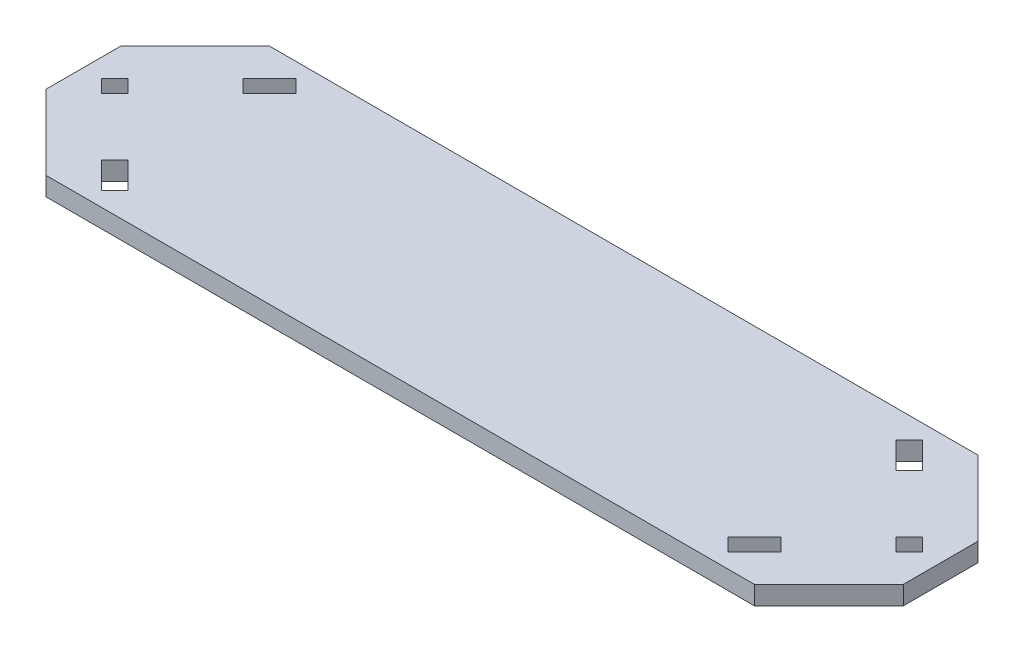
ISO-10303-21;
HEADER;
FILE_DESCRIPTION(('STEP AP214'),'2;1');
FILE_NAME('part.step','',(''),(''),'','','');
FILE_SCHEMA(('AUTOMOTIVE_DESIGN { 1 0 10303 214 1 1 1 1 }'));
ENDSEC;
DATA;
#1=APPLICATION_CONTEXT('core data for automotive mechanical design processes');
#2=APPLICATION_PROTOCOL_DEFINITION('international standard','automotive_design',2000,#1);
#3=PRODUCT_CONTEXT('',#1,'mechanical');
#4=PRODUCT('Part','Part','',(#3));
#5=PRODUCT_RELATED_PRODUCT_CATEGORY('part','',(#4));
#6=PRODUCT_DEFINITION_FORMATION('','',#4);
#7=PRODUCT_DEFINITION_CONTEXT('part definition',#1,'design');
#8=PRODUCT_DEFINITION('design','',#6,#7);
#9=PRODUCT_DEFINITION_SHAPE('','',#8);
#10=(LENGTH_UNIT() NAMED_UNIT(*) SI_UNIT(.MILLI.,.METRE.));
#11=(NAMED_UNIT(*) PLANE_ANGLE_UNIT() SI_UNIT($,.RADIAN.));
#12=(NAMED_UNIT(*) SI_UNIT($,.STERADIAN.) SOLID_ANGLE_UNIT());
#13=UNCERTAINTY_MEASURE_WITH_UNIT(LENGTH_MEASURE(1.E-05),#10,'distance_accuracy_value','');
#14=(GEOMETRIC_REPRESENTATION_CONTEXT(3) GLOBAL_UNCERTAINTY_ASSIGNED_CONTEXT((#13)) GLOBAL_UNIT_ASSIGNED_CONTEXT((#10,
#11,#12)) REPRESENTATION_CONTEXT('',''));
#15=CARTESIAN_POINT('',(0.,0.,0.));
#16=DIRECTION('',(0.,0.,1.));
#17=DIRECTION('',(1.,0.,0.));
#18=AXIS2_PLACEMENT_3D('',#15,#16,#17);
#19=CARTESIAN_POINT('',(0.,6.35,0.));
#20=DIRECTION('',(0.,1.,0.));
#21=DIRECTION('',(0.,0.,1.));
#22=AXIS2_PLACEMENT_3D('',#19,#20,#21);
#23=PLANE('',#22);
#24=DIRECTION('',(-0.707106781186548,0.,0.707106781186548));
#25=VECTOR('',#24,1.);
#26=CARTESIAN_POINT('',(115.705384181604,6.35,-24.0848719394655));
#27=LINE('',#26,#25);
#28=CARTESIAN_POINT('',(115.705384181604,6.35,-24.0848719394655));
#29=VERTEX_POINT('',#28);
#30=CARTESIAN_POINT('',(111.215256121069,6.35,-19.5947438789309));
#31=VERTEX_POINT('',#30);
#32=EDGE_CURVE('E289',#29,#31,#27,.T.);
#33=ORIENTED_EDGE('',*,*,#32,.T.);
#34=DIRECTION('',(-0.707106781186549,0.,-0.707106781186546));
#35=VECTOR('',#34,1.);
#36=CARTESIAN_POINT('',(111.215256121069,6.35,-19.5947438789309));
#37=LINE('',#36,#35);
#38=CARTESIAN_POINT('',(102.235,6.35,-28.575));
#39=VERTEX_POINT('',#38);
#40=EDGE_CURVE('E272',#31,#39,#37,.T.);
#41=ORIENTED_EDGE('',*,*,#40,.T.);
#42=DIRECTION('',(0.707106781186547,0.,-0.707106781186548));
#43=VECTOR('',#42,1.);
#44=CARTESIAN_POINT('',(102.235,6.35,-28.575));
#45=LINE('',#44,#43);
#46=CARTESIAN_POINT('',(106.725128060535,6.35,-33.0651280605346));
#47=VERTEX_POINT('',#46);
#48=EDGE_CURVE('E279',#39,#47,#45,.T.);
#49=ORIENTED_EDGE('',*,*,#48,.T.);
#50=DIRECTION('',(0.707106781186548,0.,0.707106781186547));
#51=VECTOR('',#50,1.);
#52=CARTESIAN_POINT('',(106.725128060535,6.35,-33.0651280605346));
#53=LINE('',#52,#51);
#54=EDGE_CURVE('E292',#47,#29,#53,.T.);
#55=ORIENTED_EDGE('',*,*,#54,.T.);
#56=EDGE_LOOP('',(#33,#41,#49,#55));
#57=FACE_BOUND('',#56,.T.);
#58=DIRECTION('',(0.,0.,-1.));
#59=VECTOR('',#58,1.);
#60=CARTESIAN_POINT('',(146.05,6.35,38.1));
#61=LINE('',#60,#59);
#62=CARTESIAN_POINT('',(146.05,6.35,12.7));
#63=VERTEX_POINT('',#62);
#64=CARTESIAN_POINT('',(146.05,6.35,-12.6999999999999));
#65=VERTEX_POINT('',#64);
#66=EDGE_CURVE('E444',#63,#65,#61,.T.);
#67=ORIENTED_EDGE('',*,*,#66,.T.);
#68=DIRECTION('',(0.707106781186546,0.,0.707106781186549));
#69=VECTOR('',#68,1.);
#70=CARTESIAN_POINT('',(79.3750000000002,6.35,-79.3749999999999));
#71=LINE('',#70,#69);
#72=CARTESIAN_POINT('',(120.65,6.35,-38.1));
#73=VERTEX_POINT('',#72);
#74=EDGE_CURVE('E481',#65,#73,#71,.F.);
#75=ORIENTED_EDGE('',*,*,#74,.T.);
#76=DIRECTION('',(-1.,0.,0.));
#77=VECTOR('',#76,1.);
#78=CARTESIAN_POINT('',(146.05,6.35,-38.1));
#79=LINE('',#78,#77);
#80=CARTESIAN_POINT('',(-120.65,6.35,-38.1));
#81=VERTEX_POINT('',#80);
#82=EDGE_CURVE('E434',#73,#81,#79,.T.);
#83=ORIENTED_EDGE('',*,*,#82,.T.);
#84=DIRECTION('',(0.707106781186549,0.,-0.707106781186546));
#85=VECTOR('',#84,1.);
#86=CARTESIAN_POINT('',(-79.3749999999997,6.35,-79.375));
#87=LINE('',#86,#85);
#88=CARTESIAN_POINT('',(-146.05,6.35,-12.7));
#89=VERTEX_POINT('',#88);
#90=EDGE_CURVE('E477',#81,#89,#87,.F.);
#91=ORIENTED_EDGE('',*,*,#90,.T.);
#92=DIRECTION('',(0.,0.,1.));
#93=VECTOR('',#92,1.);
#94=CARTESIAN_POINT('',(-146.05,6.35,-38.1));
#95=LINE('',#94,#93);
#96=CARTESIAN_POINT('',(-146.05,6.35,12.6999999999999));
#97=VERTEX_POINT('',#96);
#98=EDGE_CURVE('E437',#89,#97,#95,.T.);
#99=ORIENTED_EDGE('',*,*,#98,.T.);
#100=DIRECTION('',(-0.707106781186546,0.,-0.707106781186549));
#101=VECTOR('',#100,1.);
#102=CARTESIAN_POINT('',(-79.3750000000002,6.35,79.3749999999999));
#103=LINE('',#102,#101);
#104=CARTESIAN_POINT('',(-120.65,6.35,38.1));
#105=VERTEX_POINT('',#104);
#106=EDGE_CURVE('E475',#97,#105,#103,.F.);
#107=ORIENTED_EDGE('',*,*,#106,.T.);
#108=DIRECTION('',(1.,0.,0.));
#109=VECTOR('',#108,1.);
#110=CARTESIAN_POINT('',(-146.05,6.35,38.1));
#111=LINE('',#110,#109);
#112=CARTESIAN_POINT('',(120.65,6.35,38.1));
#113=VERTEX_POINT('',#112);
#114=EDGE_CURVE('E441',#105,#113,#111,.T.);
#115=ORIENTED_EDGE('',*,*,#114,.T.);
#116=DIRECTION('',(-0.707106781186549,0.,0.707106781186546));
#117=VECTOR('',#116,1.);
#118=CARTESIAN_POINT('',(79.3749999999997,6.35,79.375));
#119=LINE('',#118,#117);
#120=EDGE_CURVE('E479',#113,#63,#119,.F.);
#121=ORIENTED_EDGE('',*,*,#120,.T.);
#122=EDGE_LOOP('',(#67,#75,#83,#91,#99,#107,#115,#121));
#123=FACE_BOUND('',#122,.T.);
#124=DIRECTION('',(-0.707106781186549,0.,-0.707106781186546));
#125=VECTOR('',#124,1.);
#126=CARTESIAN_POINT('',(-135.300128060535,6.35,-4.49012806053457));
#127=LINE('',#126,#125);
#128=CARTESIAN_POINT('',(-130.81,6.35,0.));
#129=VERTEX_POINT('',#128);
#130=CARTESIAN_POINT('',(-135.300128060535,6.35,-4.49012806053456));
#131=VERTEX_POINT('',#130);
#132=EDGE_CURVE('E395',#129,#131,#127,.T.);
#133=ORIENTED_EDGE('',*,*,#132,.F.);
#134=DIRECTION('',(0.707106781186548,0.,-0.707106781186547));
#135=VECTOR('',#134,1.);
#136=CARTESIAN_POINT('',(-130.81,6.35,0.));
#137=LINE('',#136,#135);
#138=CARTESIAN_POINT('',(-135.300128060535,6.35,4.49012806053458));
#139=VERTEX_POINT('',#138);
#140=EDGE_CURVE('E406',#139,#129,#137,.T.);
#141=ORIENTED_EDGE('',*,*,#140,.F.);
#142=DIRECTION('',(0.707106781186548,0.,0.707106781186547));
#143=VECTOR('',#142,1.);
#144=CARTESIAN_POINT('',(-135.300128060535,6.35,4.49012806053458));
#145=LINE('',#144,#143);
#146=CARTESIAN_POINT('',(-139.790256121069,6.35,0.));
#147=VERTEX_POINT('',#146);
#148=EDGE_CURVE('E420',#147,#139,#145,.T.);
#149=ORIENTED_EDGE('',*,*,#148,.F.);
#150=DIRECTION('',(-0.707106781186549,0.,0.707106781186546));
#151=VECTOR('',#150,1.);
#152=CARTESIAN_POINT('',(-139.790256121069,6.35,0.));
#153=LINE('',#152,#151);
#154=EDGE_CURVE('E417',#131,#147,#153,.T.);
#155=ORIENTED_EDGE('',*,*,#154,.F.);
#156=EDGE_LOOP('',(#133,#141,#149,#155));
#157=FACE_BOUND('',#156,.T.);
#158=DIRECTION('',(0.707106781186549,0.,-0.707106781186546));
#159=VECTOR('',#158,1.);
#160=CARTESIAN_POINT('',(-111.215256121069,6.35,-19.5947438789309));
#161=LINE('',#160,#159);
#162=CARTESIAN_POINT('',(-111.215256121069,6.35,-19.5947438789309));
#163=VERTEX_POINT('',#162);
#164=CARTESIAN_POINT('',(-102.235,6.35,-28.575));
#165=VERTEX_POINT('',#164);
#166=EDGE_CURVE('E363',#163,#165,#161,.T.);
#167=ORIENTED_EDGE('',*,*,#166,.F.);
#168=DIRECTION('',(0.707106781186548,0.,0.707106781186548));
#169=VECTOR('',#168,1.);
#170=CARTESIAN_POINT('',(-115.705384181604,6.35,-24.0848719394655));
#171=LINE('',#170,#169);
#172=CARTESIAN_POINT('',(-115.705384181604,6.35,-24.0848719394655));
#173=VERTEX_POINT('',#172);
#174=EDGE_CURVE('E374',#173,#163,#171,.T.);
#175=ORIENTED_EDGE('',*,*,#174,.F.);
#176=DIRECTION('',(-0.707106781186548,0.,0.707106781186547));
#177=VECTOR('',#176,1.);
#178=CARTESIAN_POINT('',(-106.725128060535,6.35,-33.0651280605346));
#179=LINE('',#178,#177);
#180=CARTESIAN_POINT('',(-106.725128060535,6.35,-33.0651280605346));
#181=VERTEX_POINT('',#180);
#182=EDGE_CURVE('E388',#181,#173,#179,.T.);
#183=ORIENTED_EDGE('',*,*,#182,.F.);
#184=DIRECTION('',(-0.707106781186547,0.,-0.707106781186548));
#185=VECTOR('',#184,1.);
#186=CARTESIAN_POINT('',(-102.235,6.35,-28.575));
#187=LINE('',#186,#185);
#188=EDGE_CURVE('E385',#165,#181,#187,.T.);
#189=ORIENTED_EDGE('',*,*,#188,.F.);
#190=EDGE_LOOP('',(#167,#175,#183,#189));
#191=FACE_BOUND('',#190,.T.);
#192=DIRECTION('',(-0.707106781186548,0.,-0.707106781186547));
#193=VECTOR('',#192,1.);
#194=CARTESIAN_POINT('',(-111.215256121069,6.35,19.5947438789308));
#195=LINE('',#194,#193);
#196=CARTESIAN_POINT('',(-102.235,6.35,28.575));
#197=VERTEX_POINT('',#196);
#198=CARTESIAN_POINT('',(-111.215256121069,6.35,19.5947438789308));
#199=VERTEX_POINT('',#198);
#200=EDGE_CURVE('E331',#197,#199,#195,.T.);
#201=ORIENTED_EDGE('',*,*,#200,.F.);
#202=DIRECTION('',(0.707106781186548,0.,-0.707106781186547));
#203=VECTOR('',#202,1.);
#204=CARTESIAN_POINT('',(-102.235,6.35,28.575));
#205=LINE('',#204,#203);
#206=CARTESIAN_POINT('',(-106.725128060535,6.35,33.0651280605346));
#207=VERTEX_POINT('',#206);
#208=EDGE_CURVE('E342',#207,#197,#205,.T.);
#209=ORIENTED_EDGE('',*,*,#208,.F.);
#210=DIRECTION('',(0.707106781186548,0.,0.707106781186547));
#211=VECTOR('',#210,1.);
#212=CARTESIAN_POINT('',(-106.725128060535,6.35,33.0651280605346));
#213=LINE('',#212,#211);
#214=CARTESIAN_POINT('',(-115.705384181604,6.35,24.0848719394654));
#215=VERTEX_POINT('',#214);
#216=EDGE_CURVE('E356',#215,#207,#213,.T.);
#217=ORIENTED_EDGE('',*,*,#216,.F.);
#218=DIRECTION('',(-0.707106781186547,0.,0.707106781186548));
#219=VECTOR('',#218,1.);
#220=CARTESIAN_POINT('',(-115.705384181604,6.35,24.0848719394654));
#221=LINE('',#220,#219);
#222=EDGE_CURVE('E353',#199,#215,#221,.T.);
#223=ORIENTED_EDGE('',*,*,#222,.F.);
#224=EDGE_LOOP('',(#201,#209,#217,#223));
#225=FACE_BOUND('',#224,.T.);
#226=DIRECTION('',(-0.707106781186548,0.,-0.707106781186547));
#227=VECTOR('',#226,1.);
#228=CARTESIAN_POINT('',(130.81,6.35,0.));
#229=LINE('',#228,#227);
#230=CARTESIAN_POINT('',(135.300128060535,6.35,4.49012806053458));
#231=VERTEX_POINT('',#230);
#232=CARTESIAN_POINT('',(130.81,6.35,0.));
#233=VERTEX_POINT('',#232);
#234=EDGE_CURVE('E320',#231,#233,#229,.T.);
#235=ORIENTED_EDGE('',*,*,#234,.T.);
#236=DIRECTION('',(0.707106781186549,0.,-0.707106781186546));
#237=VECTOR('',#236,1.);
#238=CARTESIAN_POINT('',(135.300128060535,6.35,-4.49012806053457));
#239=LINE('',#238,#237);
#240=CARTESIAN_POINT('',(135.300128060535,6.35,-4.49012806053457));
#241=VERTEX_POINT('',#240);
#242=EDGE_CURVE('E300',#233,#241,#239,.T.);
#243=ORIENTED_EDGE('',*,*,#242,.T.);
#244=DIRECTION('',(0.707106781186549,0.,0.707106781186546));
#245=VECTOR('',#244,1.);
#246=CARTESIAN_POINT('',(139.790256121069,6.35,0.));
#247=LINE('',#246,#245);
#248=CARTESIAN_POINT('',(139.790256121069,6.35,0.));
#249=VERTEX_POINT('',#248);
#250=EDGE_CURVE('E310',#241,#249,#247,.T.);
#251=ORIENTED_EDGE('',*,*,#250,.T.);
#252=DIRECTION('',(-0.707106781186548,0.,0.707106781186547));
#253=VECTOR('',#252,1.);
#254=CARTESIAN_POINT('',(135.300128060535,6.35,4.49012806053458));
#255=LINE('',#254,#253);
#256=EDGE_CURVE('E323',#249,#231,#255,.T.);
#257=ORIENTED_EDGE('',*,*,#256,.T.);
#258=EDGE_LOOP('',(#235,#243,#251,#257));
#259=FACE_BOUND('',#258,.T.);
#260=DIRECTION('',(-0.707106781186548,0.,-0.707106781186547));
#261=VECTOR('',#260,1.);
#262=CARTESIAN_POINT('',(102.235,6.35,28.575));
#263=LINE('',#262,#261);
#264=CARTESIAN_POINT('',(106.725128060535,6.35,33.0651280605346));
#265=VERTEX_POINT('',#264);
#266=CARTESIAN_POINT('',(102.235,6.35,28.575));
#267=VERTEX_POINT('',#266);
#268=EDGE_CURVE('E266',#265,#267,#263,.T.);
#269=ORIENTED_EDGE('',*,*,#268,.T.);
#270=DIRECTION('',(0.707106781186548,0.,-0.707106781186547));
#271=VECTOR('',#270,1.);
#272=CARTESIAN_POINT('',(111.215256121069,6.35,19.5947438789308));
#273=LINE('',#272,#271);
#274=CARTESIAN_POINT('',(111.215256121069,6.35,19.5947438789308));
#275=VERTEX_POINT('',#274);
#276=EDGE_CURVE('E47',#267,#275,#273,.T.);
#277=ORIENTED_EDGE('',*,*,#276,.T.);
#278=DIRECTION('',(0.707106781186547,0.,0.707106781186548));
#279=VECTOR('',#278,1.);
#280=CARTESIAN_POINT('',(115.705384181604,6.35,24.0848719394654));
#281=LINE('',#280,#279);
#282=CARTESIAN_POINT('',(115.705384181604,6.35,24.0848719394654));
#283=VERTEX_POINT('',#282);
#284=EDGE_CURVE('E257',#275,#283,#281,.T.);
#285=ORIENTED_EDGE('',*,*,#284,.T.);
#286=DIRECTION('',(-0.707106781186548,0.,0.707106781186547));
#287=VECTOR('',#286,1.);
#288=CARTESIAN_POINT('',(106.725128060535,6.35,33.0651280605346));
#289=LINE('',#288,#287);
#290=EDGE_CURVE('E260',#283,#265,#289,.T.);
#291=ORIENTED_EDGE('',*,*,#290,.T.);
#292=EDGE_LOOP('',(#269,#277,#285,#291));
#293=FACE_BOUND('',#292,.T.);
#294=ADVANCED_FACE('F32',(#57,#123,#157,#191,#225,#259,#293),#23,.T.);
#295=CARTESIAN_POINT('',(0.,0.,0.));
#296=DIRECTION('',(0.,1.,0.));
#297=DIRECTION('',(0.,0.,1.));
#298=AXIS2_PLACEMENT_3D('',#295,#296,#297);
#299=PLANE('',#298);
#300=DIRECTION('',(-0.707106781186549,0.,-0.707106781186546));
#301=VECTOR('',#300,1.);
#302=CARTESIAN_POINT('',(111.215256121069,0.,-19.5947438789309));
#303=LINE('',#302,#301);
#304=CARTESIAN_POINT('',(111.215256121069,0.,-19.5947438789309));
#305=VERTEX_POINT('',#304);
#306=CARTESIAN_POINT('',(102.235,0.,-28.575));
#307=VERTEX_POINT('',#306);
#308=EDGE_CURVE('E276',#305,#307,#303,.T.);
#309=ORIENTED_EDGE('',*,*,#308,.F.);
#310=DIRECTION('',(-0.707106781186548,0.,0.707106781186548));
#311=VECTOR('',#310,1.);
#312=CARTESIAN_POINT('',(115.705384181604,0.,-24.0848719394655));
#313=LINE('',#312,#311);
#314=CARTESIAN_POINT('',(115.705384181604,0.,-24.0848719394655));
#315=VERTEX_POINT('',#314);
#316=EDGE_CURVE('E278',#315,#305,#313,.T.);
#317=ORIENTED_EDGE('',*,*,#316,.F.);
#318=DIRECTION('',(0.707106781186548,0.,0.707106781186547));
#319=VECTOR('',#318,1.);
#320=CARTESIAN_POINT('',(106.725128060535,0.,-33.0651280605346));
#321=LINE('',#320,#319);
#322=CARTESIAN_POINT('',(106.725128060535,0.,-33.0651280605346));
#323=VERTEX_POINT('',#322);
#324=EDGE_CURVE('E281',#323,#315,#321,.T.);
#325=ORIENTED_EDGE('',*,*,#324,.F.);
#326=DIRECTION('',(0.707106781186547,0.,-0.707106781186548));
#327=VECTOR('',#326,1.);
#328=CARTESIAN_POINT('',(102.235,0.,-28.575));
#329=LINE('',#328,#327);
#330=EDGE_CURVE('E284',#307,#323,#329,.T.);
#331=ORIENTED_EDGE('',*,*,#330,.F.);
#332=EDGE_LOOP('',(#309,#317,#325,#331));
#333=FACE_BOUND('',#332,.T.);
#334=DIRECTION('',(-1.,0.,0.));
#335=VECTOR('',#334,1.);
#336=CARTESIAN_POINT('',(146.05,0.,-38.1));
#337=LINE('',#336,#335);
#338=CARTESIAN_POINT('',(120.65,0.,-38.1));
#339=VERTEX_POINT('',#338);
#340=CARTESIAN_POINT('',(-120.65,0.,-38.1));
#341=VERTEX_POINT('',#340);
#342=EDGE_CURVE('E427',#339,#341,#337,.T.);
#343=ORIENTED_EDGE('',*,*,#342,.F.);
#344=DIRECTION('',(-0.707106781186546,0.,-0.707106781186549));
#345=VECTOR('',#344,1.);
#346=CARTESIAN_POINT('',(120.65,0.,-38.1));
#347=LINE('',#346,#345);
#348=CARTESIAN_POINT('',(146.05,0.,-12.6999999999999));
#349=VERTEX_POINT('',#348);
#350=EDGE_CURVE('E468',#339,#349,#347,.F.);
#351=ORIENTED_EDGE('',*,*,#350,.T.);
#352=DIRECTION('',(0.,0.,-1.));
#353=VECTOR('',#352,1.);
#354=CARTESIAN_POINT('',(146.05,0.,38.1));
#355=LINE('',#354,#353);
#356=CARTESIAN_POINT('',(146.05,0.,12.7));
#357=VERTEX_POINT('',#356);
#358=EDGE_CURVE('E438',#357,#349,#355,.T.);
#359=ORIENTED_EDGE('',*,*,#358,.F.);
#360=DIRECTION('',(0.707106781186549,0.,-0.707106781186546));
#361=VECTOR('',#360,1.);
#362=CARTESIAN_POINT('',(146.05,0.,12.7));
#363=LINE('',#362,#361);
#364=CARTESIAN_POINT('',(120.65,0.,38.1));
#365=VERTEX_POINT('',#364);
#366=EDGE_CURVE('E466',#357,#365,#363,.F.);
#367=ORIENTED_EDGE('',*,*,#366,.T.);
#368=DIRECTION('',(1.,0.,0.));
#369=VECTOR('',#368,1.);
#370=CARTESIAN_POINT('',(-146.05,0.,38.1));
#371=LINE('',#370,#369);
#372=CARTESIAN_POINT('',(-120.65,0.,38.1));
#373=VERTEX_POINT('',#372);
#374=EDGE_CURVE('E453',#373,#365,#371,.T.);
#375=ORIENTED_EDGE('',*,*,#374,.F.);
#376=DIRECTION('',(0.707106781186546,0.,0.707106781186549));
#377=VECTOR('',#376,1.);
#378=CARTESIAN_POINT('',(-120.65,0.,38.1));
#379=LINE('',#378,#377);
#380=CARTESIAN_POINT('',(-146.05,0.,12.6999999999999));
#381=VERTEX_POINT('',#380);
#382=EDGE_CURVE('E462',#373,#381,#379,.F.);
#383=ORIENTED_EDGE('',*,*,#382,.T.);
#384=DIRECTION('',(0.,0.,1.));
#385=VECTOR('',#384,1.);
#386=CARTESIAN_POINT('',(-146.05,0.,-38.1));
#387=LINE('',#386,#385);
#388=CARTESIAN_POINT('',(-146.05,0.,-12.7));
#389=VERTEX_POINT('',#388);
#390=EDGE_CURVE('E450',#389,#381,#387,.T.);
#391=ORIENTED_EDGE('',*,*,#390,.F.);
#392=DIRECTION('',(-0.707106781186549,0.,0.707106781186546));
#393=VECTOR('',#392,1.);
#394=CARTESIAN_POINT('',(-146.05,0.,-12.7));
#395=LINE('',#394,#393);
#396=EDGE_CURVE('E464',#389,#341,#395,.F.);
#397=ORIENTED_EDGE('',*,*,#396,.T.);
#398=EDGE_LOOP('',(#343,#351,#359,#367,#375,#383,#391,#397));
#399=FACE_BOUND('',#398,.T.);
#400=DIRECTION('',(0.707106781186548,0.,-0.707106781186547));
#401=VECTOR('',#400,1.);
#402=CARTESIAN_POINT('',(-130.81,0.,0.));
#403=LINE('',#402,#401);
#404=CARTESIAN_POINT('',(-135.300128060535,0.,4.49012806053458));
#405=VERTEX_POINT('',#404);
#406=CARTESIAN_POINT('',(-130.81,0.,0.));
#407=VERTEX_POINT('',#406);
#408=EDGE_CURVE('E412',#405,#407,#403,.T.);
#409=ORIENTED_EDGE('',*,*,#408,.T.);
#410=DIRECTION('',(-0.707106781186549,0.,-0.707106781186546));
#411=VECTOR('',#410,1.);
#412=CARTESIAN_POINT('',(-135.300128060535,0.,-4.49012806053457));
#413=LINE('',#412,#411);
#414=CARTESIAN_POINT('',(-135.300128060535,0.,-4.49012806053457));
#415=VERTEX_POINT('',#414);
#416=EDGE_CURVE('E402',#407,#415,#413,.T.);
#417=ORIENTED_EDGE('',*,*,#416,.T.);
#418=DIRECTION('',(-0.707106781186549,0.,0.707106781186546));
#419=VECTOR('',#418,1.);
#420=CARTESIAN_POINT('',(-139.790256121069,0.,0.));
#421=LINE('',#420,#419);
#422=CARTESIAN_POINT('',(-139.790256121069,0.,0.));
#423=VERTEX_POINT('',#422);
#424=EDGE_CURVE('E405',#415,#423,#421,.T.);
#425=ORIENTED_EDGE('',*,*,#424,.T.);
#426=DIRECTION('',(0.707106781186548,0.,0.707106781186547));
#427=VECTOR('',#426,1.);
#428=CARTESIAN_POINT('',(-135.300128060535,0.,4.49012806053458));
#429=LINE('',#428,#427);
#430=EDGE_CURVE('E409',#423,#405,#429,.T.);
#431=ORIENTED_EDGE('',*,*,#430,.T.);
#432=EDGE_LOOP('',(#409,#417,#425,#431));
#433=FACE_BOUND('',#432,.T.);
#434=DIRECTION('',(0.707106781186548,0.,0.707106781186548));
#435=VECTOR('',#434,1.);
#436=CARTESIAN_POINT('',(-115.705384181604,0.,-24.0848719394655));
#437=LINE('',#436,#435);
#438=CARTESIAN_POINT('',(-115.705384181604,0.,-24.0848719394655));
#439=VERTEX_POINT('',#438);
#440=CARTESIAN_POINT('',(-111.215256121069,0.,-19.5947438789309));
#441=VERTEX_POINT('',#440);
#442=EDGE_CURVE('E380',#439,#441,#437,.T.);
#443=ORIENTED_EDGE('',*,*,#442,.T.);
#444=DIRECTION('',(0.707106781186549,0.,-0.707106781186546));
#445=VECTOR('',#444,1.);
#446=CARTESIAN_POINT('',(-111.215256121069,0.,-19.5947438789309));
#447=LINE('',#446,#445);
#448=CARTESIAN_POINT('',(-102.235,0.,-28.575));
#449=VERTEX_POINT('',#448);
#450=EDGE_CURVE('E370',#441,#449,#447,.T.);
#451=ORIENTED_EDGE('',*,*,#450,.T.);
#452=DIRECTION('',(-0.707106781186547,0.,-0.707106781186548));
#453=VECTOR('',#452,1.);
#454=CARTESIAN_POINT('',(-102.235,0.,-28.575));
#455=LINE('',#454,#453);
#456=CARTESIAN_POINT('',(-106.725128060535,0.,-33.0651280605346));
#457=VERTEX_POINT('',#456);
#458=EDGE_CURVE('E373',#449,#457,#455,.T.);
#459=ORIENTED_EDGE('',*,*,#458,.T.);
#460=DIRECTION('',(-0.707106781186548,0.,0.707106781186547));
#461=VECTOR('',#460,1.);
#462=CARTESIAN_POINT('',(-106.725128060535,0.,-33.0651280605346));
#463=LINE('',#462,#461);
#464=EDGE_CURVE('E377',#457,#439,#463,.T.);
#465=ORIENTED_EDGE('',*,*,#464,.T.);
#466=EDGE_LOOP('',(#443,#451,#459,#465));
#467=FACE_BOUND('',#466,.T.);
#468=DIRECTION('',(0.707106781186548,0.,-0.707106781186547));
#469=VECTOR('',#468,1.);
#470=CARTESIAN_POINT('',(-102.235,0.,28.575));
#471=LINE('',#470,#469);
#472=CARTESIAN_POINT('',(-106.725128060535,0.,33.0651280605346));
#473=VERTEX_POINT('',#472);
#474=CARTESIAN_POINT('',(-102.235,0.,28.575));
#475=VERTEX_POINT('',#474);
#476=EDGE_CURVE('E348',#473,#475,#471,.T.);
#477=ORIENTED_EDGE('',*,*,#476,.T.);
#478=DIRECTION('',(-0.707106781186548,0.,-0.707106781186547));
#479=VECTOR('',#478,1.);
#480=CARTESIAN_POINT('',(-111.215256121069,0.,19.5947438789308));
#481=LINE('',#480,#479);
#482=CARTESIAN_POINT('',(-111.215256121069,0.,19.5947438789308));
#483=VERTEX_POINT('',#482);
#484=EDGE_CURVE('E338',#475,#483,#481,.T.);
#485=ORIENTED_EDGE('',*,*,#484,.T.);
#486=DIRECTION('',(-0.707106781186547,0.,0.707106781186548));
#487=VECTOR('',#486,1.);
#488=CARTESIAN_POINT('',(-115.705384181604,0.,24.0848719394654));
#489=LINE('',#488,#487);
#490=CARTESIAN_POINT('',(-115.705384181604,0.,24.0848719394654));
#491=VERTEX_POINT('',#490);
#492=EDGE_CURVE('E341',#483,#491,#489,.T.);
#493=ORIENTED_EDGE('',*,*,#492,.T.);
#494=DIRECTION('',(0.707106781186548,0.,0.707106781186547));
#495=VECTOR('',#494,1.);
#496=CARTESIAN_POINT('',(-106.725128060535,0.,33.0651280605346));
#497=LINE('',#496,#495);
#498=EDGE_CURVE('E345',#491,#473,#497,.T.);
#499=ORIENTED_EDGE('',*,*,#498,.T.);
#500=EDGE_LOOP('',(#477,#485,#493,#499));
#501=FACE_BOUND('',#500,.T.);
#502=DIRECTION('',(0.707106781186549,0.,-0.707106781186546));
#503=VECTOR('',#502,1.);
#504=CARTESIAN_POINT('',(135.300128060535,0.,-4.49012806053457));
#505=LINE('',#504,#503);
#506=CARTESIAN_POINT('',(130.81,0.,0.));
#507=VERTEX_POINT('',#506);
#508=CARTESIAN_POINT('',(135.300128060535,0.,-4.49012806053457));
#509=VERTEX_POINT('',#508);
#510=EDGE_CURVE('E307',#507,#509,#505,.T.);
#511=ORIENTED_EDGE('',*,*,#510,.F.);
#512=DIRECTION('',(-0.707106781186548,0.,-0.707106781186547));
#513=VECTOR('',#512,1.);
#514=CARTESIAN_POINT('',(130.81,0.,0.));
#515=LINE('',#514,#513);
#516=CARTESIAN_POINT('',(135.300128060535,0.,4.49012806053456));
#517=VERTEX_POINT('',#516);
#518=EDGE_CURVE('E309',#517,#507,#515,.T.);
#519=ORIENTED_EDGE('',*,*,#518,.F.);
#520=DIRECTION('',(-0.707106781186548,0.,0.707106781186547));
#521=VECTOR('',#520,1.);
#522=CARTESIAN_POINT('',(135.300128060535,0.,4.49012806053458));
#523=LINE('',#522,#521);
#524=CARTESIAN_POINT('',(139.790256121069,0.,0.));
#525=VERTEX_POINT('',#524);
#526=EDGE_CURVE('E312',#525,#517,#523,.T.);
#527=ORIENTED_EDGE('',*,*,#526,.F.);
#528=DIRECTION('',(0.707106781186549,0.,0.707106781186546));
#529=VECTOR('',#528,1.);
#530=CARTESIAN_POINT('',(139.790256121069,0.,0.));
#531=LINE('',#530,#529);
#532=EDGE_CURVE('E315',#509,#525,#531,.T.);
#533=ORIENTED_EDGE('',*,*,#532,.F.);
#534=EDGE_LOOP('',(#511,#519,#527,#533));
#535=FACE_BOUND('',#534,.T.);
#536=DIRECTION('',(0.707106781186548,0.,-0.707106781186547));
#537=VECTOR('',#536,1.);
#538=CARTESIAN_POINT('',(111.215256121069,0.,19.5947438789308));
#539=LINE('',#538,#537);
#540=CARTESIAN_POINT('',(102.235,0.,28.575));
#541=VERTEX_POINT('',#540);
#542=CARTESIAN_POINT('',(111.215256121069,0.,19.5947438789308));
#543=VERTEX_POINT('',#542);
#544=EDGE_CURVE('E249',#541,#543,#539,.T.);
#545=ORIENTED_EDGE('',*,*,#544,.F.);
#546=DIRECTION('',(-0.707106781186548,0.,-0.707106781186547));
#547=VECTOR('',#546,1.);
#548=CARTESIAN_POINT('',(102.235,0.,28.575));
#549=LINE('',#548,#547);
#550=CARTESIAN_POINT('',(106.725128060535,0.,33.0651280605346));
#551=VERTEX_POINT('',#550);
#552=EDGE_CURVE('E241',#551,#541,#549,.T.);
#553=ORIENTED_EDGE('',*,*,#552,.F.);
#554=DIRECTION('',(-0.707106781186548,0.,0.707106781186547));
#555=VECTOR('',#554,1.);
#556=CARTESIAN_POINT('',(106.725128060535,0.,33.0651280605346));
#557=LINE('',#556,#555);
#558=CARTESIAN_POINT('',(115.705384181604,0.,24.0848719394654));
#559=VERTEX_POINT('',#558);
#560=EDGE_CURVE('E248',#559,#551,#557,.T.);
#561=ORIENTED_EDGE('',*,*,#560,.F.);
#562=DIRECTION('',(0.707106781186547,0.,0.707106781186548));
#563=VECTOR('',#562,1.);
#564=CARTESIAN_POINT('',(115.705384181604,0.,24.0848719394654));
#565=LINE('',#564,#563);
#566=EDGE_CURVE('E253',#543,#559,#565,.T.);
#567=ORIENTED_EDGE('',*,*,#566,.F.);
#568=EDGE_LOOP('',(#545,#553,#561,#567));
#569=FACE_BOUND('',#568,.T.);
#570=ADVANCED_FACE('F256',(#333,#399,#433,#467,#501,#535,#569),#299,.F.);
#571=CARTESIAN_POINT('',(146.05,6.35,-38.1));
#572=DIRECTION('',(0.,0.,1.));
#573=DIRECTION('',(1.,0.,0.));
#574=AXIS2_PLACEMENT_3D('',#571,#572,#573);
#575=PLANE('',#574);
#576=ORIENTED_EDGE('',*,*,#82,.F.);
#577=DIRECTION('',(0.,-1.,0.));
#578=VECTOR('',#577,1.);
#579=CARTESIAN_POINT('',(120.65,6.35,-38.1));
#580=LINE('',#579,#578);
#581=EDGE_CURVE('E459',#73,#339,#580,.T.);
#582=ORIENTED_EDGE('',*,*,#581,.T.);
#583=ORIENTED_EDGE('',*,*,#342,.T.);
#584=DIRECTION('',(0.,1.,0.));
#585=VECTOR('',#584,1.);
#586=CARTESIAN_POINT('',(-120.65,6.35,-38.1));
#587=LINE('',#586,#585);
#588=EDGE_CURVE('E447',#341,#81,#587,.T.);
#589=ORIENTED_EDGE('',*,*,#588,.T.);
#590=EDGE_LOOP('',(#576,#582,#583,#589));
#591=FACE_BOUND('',#590,.T.);
#592=ADVANCED_FACE('F522',(#591),#575,.F.);
#593=CARTESIAN_POINT('',(-146.05,6.35,-38.1));
#594=DIRECTION('',(1.,0.,0.));
#595=DIRECTION('',(0.,0.,-1.));
#596=AXIS2_PLACEMENT_3D('',#593,#594,#595);
#597=PLANE('',#596);
#598=ORIENTED_EDGE('',*,*,#98,.F.);
#599=DIRECTION('',(0.,-1.,0.));
#600=VECTOR('',#599,1.);
#601=CARTESIAN_POINT('',(-146.05,6.35,-12.7));
#602=LINE('',#601,#600);
#603=EDGE_CURVE('E11',#89,#389,#602,.T.);
#604=ORIENTED_EDGE('',*,*,#603,.T.);
#605=ORIENTED_EDGE('',*,*,#390,.T.);
#606=DIRECTION('',(0.,1.,0.));
#607=VECTOR('',#606,1.);
#608=CARTESIAN_POINT('',(-146.05,6.35,12.6999999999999));
#609=LINE('',#608,#607);
#610=EDGE_CURVE('E40',#381,#97,#609,.T.);
#611=ORIENTED_EDGE('',*,*,#610,.T.);
#612=EDGE_LOOP('',(#598,#604,#605,#611));
#613=FACE_BOUND('',#612,.T.);
#614=ADVANCED_FACE('F490',(#613),#597,.F.);
#615=CARTESIAN_POINT('',(-146.05,6.35,38.1));
#616=DIRECTION('',(0.,0.,-1.));
#617=DIRECTION('',(-1.,0.,0.));
#618=AXIS2_PLACEMENT_3D('',#615,#616,#617);
#619=PLANE('',#618);
#620=ORIENTED_EDGE('',*,*,#374,.T.);
#621=DIRECTION('',(0.,1.,0.));
#622=VECTOR('',#621,1.);
#623=CARTESIAN_POINT('',(120.65,6.35,38.1));
#624=LINE('',#623,#622);
#625=EDGE_CURVE('E486',#365,#113,#624,.T.);
#626=ORIENTED_EDGE('',*,*,#625,.T.);
#627=ORIENTED_EDGE('',*,*,#114,.F.);
#628=DIRECTION('',(0.,-1.,0.));
#629=VECTOR('',#628,1.);
#630=CARTESIAN_POINT('',(-120.65,6.35,38.1));
#631=LINE('',#630,#629);
#632=EDGE_CURVE('E483',#105,#373,#631,.T.);
#633=ORIENTED_EDGE('',*,*,#632,.T.);
#634=EDGE_LOOP('',(#620,#626,#627,#633));
#635=FACE_BOUND('',#634,.T.);
#636=ADVANCED_FACE('F502',(#635),#619,.F.);
#637=CARTESIAN_POINT('',(146.05,6.35,38.1));
#638=DIRECTION('',(-1.,0.,0.));
#639=DIRECTION('',(0.,0.,1.));
#640=AXIS2_PLACEMENT_3D('',#637,#638,#639);
#641=PLANE('',#640);
#642=ORIENTED_EDGE('',*,*,#358,.T.);
#643=DIRECTION('',(0.,1.,0.));
#644=VECTOR('',#643,1.);
#645=CARTESIAN_POINT('',(146.05,6.35,-12.6999999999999));
#646=LINE('',#645,#644);
#647=EDGE_CURVE('E473',#349,#65,#646,.T.);
#648=ORIENTED_EDGE('',*,*,#647,.T.);
#649=ORIENTED_EDGE('',*,*,#66,.F.);
#650=DIRECTION('',(0.,-1.,0.));
#651=VECTOR('',#650,1.);
#652=CARTESIAN_POINT('',(146.05,6.35,12.7));
#653=LINE('',#652,#651);
#654=EDGE_CURVE('E470',#63,#357,#653,.T.);
#655=ORIENTED_EDGE('',*,*,#654,.T.);
#656=EDGE_LOOP('',(#642,#648,#649,#655));
#657=FACE_BOUND('',#656,.T.);
#658=ADVANCED_FACE('F514',(#657),#641,.F.);
#659=CARTESIAN_POINT('',(120.65,6.35,-38.1));
#660=DIRECTION('',(-0.707106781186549,0.,0.707106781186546));
#661=DIRECTION('',(0.,-1.,0.));
#662=AXIS2_PLACEMENT_3D('',#659,#660,#661);
#663=PLANE('',#662);
#664=ORIENTED_EDGE('',*,*,#74,.F.);
#665=ORIENTED_EDGE('',*,*,#647,.F.);
#666=ORIENTED_EDGE('',*,*,#350,.F.);
#667=ORIENTED_EDGE('',*,*,#581,.F.);
#668=EDGE_LOOP('',(#664,#665,#666,#667));
#669=FACE_BOUND('',#668,.T.);
#670=ADVANCED_FACE('F520',(#669),#663,.F.);
#671=CARTESIAN_POINT('',(146.05,6.35,12.7));
#672=DIRECTION('',(-0.707106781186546,0.,-0.707106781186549));
#673=DIRECTION('',(0.,-1.,0.));
#674=AXIS2_PLACEMENT_3D('',#671,#672,#673);
#675=PLANE('',#674);
#676=ORIENTED_EDGE('',*,*,#120,.F.);
#677=ORIENTED_EDGE('',*,*,#625,.F.);
#678=ORIENTED_EDGE('',*,*,#366,.F.);
#679=ORIENTED_EDGE('',*,*,#654,.F.);
#680=EDGE_LOOP('',(#676,#677,#678,#679));
#681=FACE_BOUND('',#680,.T.);
#682=ADVANCED_FACE('F511',(#681),#675,.F.);
#683=CARTESIAN_POINT('',(-146.05,6.35,-12.7));
#684=DIRECTION('',(0.707106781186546,0.,0.707106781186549));
#685=DIRECTION('',(0.,-1.,0.));
#686=AXIS2_PLACEMENT_3D('',#683,#684,#685);
#687=PLANE('',#686);
#688=ORIENTED_EDGE('',*,*,#90,.F.);
#689=ORIENTED_EDGE('',*,*,#588,.F.);
#690=ORIENTED_EDGE('',*,*,#396,.F.);
#691=ORIENTED_EDGE('',*,*,#603,.F.);
#692=EDGE_LOOP('',(#688,#689,#690,#691));
#693=FACE_BOUND('',#692,.T.);
#694=ADVANCED_FACE('F525',(#693),#687,.F.);
#695=CARTESIAN_POINT('',(-120.65,6.35,38.1));
#696=DIRECTION('',(0.707106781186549,0.,-0.707106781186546));
#697=DIRECTION('',(0.,-1.,0.));
#698=AXIS2_PLACEMENT_3D('',#695,#696,#697);
#699=PLANE('',#698);
#700=ORIENTED_EDGE('',*,*,#106,.F.);
#701=ORIENTED_EDGE('',*,*,#610,.F.);
#702=ORIENTED_EDGE('',*,*,#382,.F.);
#703=ORIENTED_EDGE('',*,*,#632,.F.);
#704=EDGE_LOOP('',(#700,#701,#702,#703));
#705=FACE_BOUND('',#704,.T.);
#706=ADVANCED_FACE('F34',(#705),#699,.F.);
#707=CARTESIAN_POINT('',(-135.300128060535,0.,-4.49012806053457));
#708=DIRECTION('',(0.707106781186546,0.,-0.707106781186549));
#709=DIRECTION('',(-0.707106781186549,0.,-0.707106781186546));
#710=AXIS2_PLACEMENT_3D('',#707,#708,#709);
#711=PLANE('',#710);
#712=ORIENTED_EDGE('',*,*,#132,.T.);
#713=DIRECTION('',(0.,1.,0.));
#714=VECTOR('',#713,1.);
#715=CARTESIAN_POINT('',(-135.300128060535,0.,-4.49012806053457));
#716=LINE('',#715,#714);
#717=EDGE_CURVE('E415',#415,#131,#716,.T.);
#718=ORIENTED_EDGE('',*,*,#717,.F.);
#719=ORIENTED_EDGE('',*,*,#416,.F.);
#720=DIRECTION('',(0.,1.,0.));
#721=VECTOR('',#720,1.);
#722=CARTESIAN_POINT('',(-130.81,0.,0.));
#723=LINE('',#722,#721);
#724=EDGE_CURVE('E425',#407,#129,#723,.T.);
#725=ORIENTED_EDGE('',*,*,#724,.T.);
#726=EDGE_LOOP('',(#712,#718,#719,#725));
#727=FACE_BOUND('',#726,.T.);
#728=ADVANCED_FACE('F531',(#727),#711,.F.);
#729=CARTESIAN_POINT('',(-130.81,0.,0.));
#730=DIRECTION('',(0.707106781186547,0.,0.707106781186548));
#731=DIRECTION('',(0.707106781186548,0.,-0.707106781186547));
#732=AXIS2_PLACEMENT_3D('',#729,#730,#731);
#733=PLANE('',#732);
#734=ORIENTED_EDGE('',*,*,#140,.T.);
#735=ORIENTED_EDGE('',*,*,#724,.F.);
#736=ORIENTED_EDGE('',*,*,#408,.F.);
#737=DIRECTION('',(0.,1.,0.));
#738=VECTOR('',#737,1.);
#739=CARTESIAN_POINT('',(-135.300128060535,0.,4.49012806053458));
#740=LINE('',#739,#738);
#741=EDGE_CURVE('E428',#405,#139,#740,.T.);
#742=ORIENTED_EDGE('',*,*,#741,.T.);
#743=EDGE_LOOP('',(#734,#735,#736,#742));
#744=FACE_BOUND('',#743,.T.);
#745=ADVANCED_FACE('F580',(#744),#733,.F.);
#746=CARTESIAN_POINT('',(-135.300128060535,0.,4.49012806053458));
#747=DIRECTION('',(-0.707106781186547,0.,0.707106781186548));
#748=DIRECTION('',(0.707106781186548,0.,0.707106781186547));
#749=AXIS2_PLACEMENT_3D('',#746,#747,#748);
#750=PLANE('',#749);
#751=ORIENTED_EDGE('',*,*,#148,.T.);
#752=ORIENTED_EDGE('',*,*,#741,.F.);
#753=ORIENTED_EDGE('',*,*,#430,.F.);
#754=DIRECTION('',(0.,1.,0.));
#755=VECTOR('',#754,1.);
#756=CARTESIAN_POINT('',(-139.790256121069,0.,0.));
#757=LINE('',#756,#755);
#758=EDGE_CURVE('E430',#423,#147,#757,.T.);
#759=ORIENTED_EDGE('',*,*,#758,.T.);
#760=EDGE_LOOP('',(#751,#752,#753,#759));
#761=FACE_BOUND('',#760,.T.);
#762=ADVANCED_FACE('F589',(#761),#750,.F.);
#763=CARTESIAN_POINT('',(-139.790256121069,0.,0.));
#764=DIRECTION('',(-0.707106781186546,0.,-0.707106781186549));
#765=DIRECTION('',(-0.707106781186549,0.,0.707106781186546));
#766=AXIS2_PLACEMENT_3D('',#763,#764,#765);
#767=PLANE('',#766);
#768=ORIENTED_EDGE('',*,*,#154,.T.);
#769=ORIENTED_EDGE('',*,*,#758,.F.);
#770=ORIENTED_EDGE('',*,*,#424,.F.);
#771=ORIENTED_EDGE('',*,*,#717,.T.);
#772=EDGE_LOOP('',(#768,#769,#770,#771));
#773=FACE_BOUND('',#772,.T.);
#774=ADVANCED_FACE('F599',(#773),#767,.F.);
#775=CARTESIAN_POINT('',(-111.215256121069,0.,-19.5947438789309));
#776=DIRECTION('',(0.707106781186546,0.,0.707106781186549));
#777=DIRECTION('',(0.707106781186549,0.,-0.707106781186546));
#778=AXIS2_PLACEMENT_3D('',#775,#776,#777);
#779=PLANE('',#778);
#780=ORIENTED_EDGE('',*,*,#166,.T.);
#781=DIRECTION('',(0.,1.,0.));
#782=VECTOR('',#781,1.);
#783=CARTESIAN_POINT('',(-102.235,0.,-28.575));
#784=LINE('',#783,#782);
#785=EDGE_CURVE('E383',#449,#165,#784,.T.);
#786=ORIENTED_EDGE('',*,*,#785,.F.);
#787=ORIENTED_EDGE('',*,*,#450,.F.);
#788=DIRECTION('',(0.,1.,0.));
#789=VECTOR('',#788,1.);
#790=CARTESIAN_POINT('',(-111.215256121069,0.,-19.5947438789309));
#791=LINE('',#790,#789);
#792=EDGE_CURVE('E393',#441,#163,#791,.T.);
#793=ORIENTED_EDGE('',*,*,#792,.T.);
#794=EDGE_LOOP('',(#780,#786,#787,#793));
#795=FACE_BOUND('',#794,.T.);
#796=ADVANCED_FACE('F609',(#795),#779,.F.);
#797=CARTESIAN_POINT('',(-115.705384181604,0.,-24.0848719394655));
#798=DIRECTION('',(-0.707106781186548,0.,0.707106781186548));
#799=DIRECTION('',(0.707106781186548,0.,0.707106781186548));
#800=AXIS2_PLACEMENT_3D('',#797,#798,#799);
#801=PLANE('',#800);
#802=ORIENTED_EDGE('',*,*,#174,.T.);
#803=ORIENTED_EDGE('',*,*,#792,.F.);
#804=ORIENTED_EDGE('',*,*,#442,.F.);
#805=DIRECTION('',(0.,1.,0.));
#806=VECTOR('',#805,1.);
#807=CARTESIAN_POINT('',(-115.705384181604,0.,-24.0848719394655));
#808=LINE('',#807,#806);
#809=EDGE_CURVE('E396',#439,#173,#808,.T.);
#810=ORIENTED_EDGE('',*,*,#809,.T.);
#811=EDGE_LOOP('',(#802,#803,#804,#810));
#812=FACE_BOUND('',#811,.T.);
#813=ADVANCED_FACE('F618',(#812),#801,.F.);
#814=CARTESIAN_POINT('',(-106.725128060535,0.,-33.0651280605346));
#815=DIRECTION('',(-0.707106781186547,0.,-0.707106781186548));
#816=DIRECTION('',(-0.707106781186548,0.,0.707106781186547));
#817=AXIS2_PLACEMENT_3D('',#814,#815,#816);
#818=PLANE('',#817);
#819=ORIENTED_EDGE('',*,*,#182,.T.);
#820=ORIENTED_EDGE('',*,*,#809,.F.);
#821=ORIENTED_EDGE('',*,*,#464,.F.);
#822=DIRECTION('',(0.,1.,0.));
#823=VECTOR('',#822,1.);
#824=CARTESIAN_POINT('',(-106.725128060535,0.,-33.0651280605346));
#825=LINE('',#824,#823);
#826=EDGE_CURVE('E398',#457,#181,#825,.T.);
#827=ORIENTED_EDGE('',*,*,#826,.T.);
#828=EDGE_LOOP('',(#819,#820,#821,#827));
#829=FACE_BOUND('',#828,.T.);
#830=ADVANCED_FACE('F628',(#829),#818,.F.);
#831=CARTESIAN_POINT('',(-102.235,0.,-28.575));
#832=DIRECTION('',(0.707106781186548,0.,-0.707106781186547));
#833=DIRECTION('',(-0.707106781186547,0.,-0.707106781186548));
#834=AXIS2_PLACEMENT_3D('',#831,#832,#833);
#835=PLANE('',#834);
#836=ORIENTED_EDGE('',*,*,#188,.T.);
#837=ORIENTED_EDGE('',*,*,#826,.F.);
#838=ORIENTED_EDGE('',*,*,#458,.F.);
#839=ORIENTED_EDGE('',*,*,#785,.T.);
#840=EDGE_LOOP('',(#836,#837,#838,#839));
#841=FACE_BOUND('',#840,.T.);
#842=ADVANCED_FACE('F638',(#841),#835,.F.);
#843=CARTESIAN_POINT('',(-111.215256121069,0.,19.5947438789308));
#844=DIRECTION('',(0.707106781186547,0.,-0.707106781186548));
#845=DIRECTION('',(-0.707106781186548,0.,-0.707106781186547));
#846=AXIS2_PLACEMENT_3D('',#843,#844,#845);
#847=PLANE('',#846);
#848=ORIENTED_EDGE('',*,*,#200,.T.);
#849=DIRECTION('',(0.,1.,0.));
#850=VECTOR('',#849,1.);
#851=CARTESIAN_POINT('',(-111.215256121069,0.,19.5947438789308));
#852=LINE('',#851,#850);
#853=EDGE_CURVE('E351',#483,#199,#852,.T.);
#854=ORIENTED_EDGE('',*,*,#853,.F.);
#855=ORIENTED_EDGE('',*,*,#484,.F.);
#856=DIRECTION('',(0.,1.,0.));
#857=VECTOR('',#856,1.);
#858=CARTESIAN_POINT('',(-102.235,0.,28.575));
#859=LINE('',#858,#857);
#860=EDGE_CURVE('E361',#475,#197,#859,.T.);
#861=ORIENTED_EDGE('',*,*,#860,.T.);
#862=EDGE_LOOP('',(#848,#854,#855,#861));
#863=FACE_BOUND('',#862,.T.);
#864=ADVANCED_FACE('F648',(#863),#847,.F.);
#865=CARTESIAN_POINT('',(-102.235,0.,28.575));
#866=DIRECTION('',(0.707106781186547,0.,0.707106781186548));
#867=DIRECTION('',(0.707106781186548,0.,-0.707106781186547));
#868=AXIS2_PLACEMENT_3D('',#865,#866,#867);
#869=PLANE('',#868);
#870=ORIENTED_EDGE('',*,*,#208,.T.);
#871=ORIENTED_EDGE('',*,*,#860,.F.);
#872=ORIENTED_EDGE('',*,*,#476,.F.);
#873=DIRECTION('',(0.,1.,0.));
#874=VECTOR('',#873,1.);
#875=CARTESIAN_POINT('',(-106.725128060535,0.,33.0651280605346));
#876=LINE('',#875,#874);
#877=EDGE_CURVE('E364',#473,#207,#876,.T.);
#878=ORIENTED_EDGE('',*,*,#877,.T.);
#879=EDGE_LOOP('',(#870,#871,#872,#878));
#880=FACE_BOUND('',#879,.T.);
#881=ADVANCED_FACE('F658',(#880),#869,.F.);
#882=CARTESIAN_POINT('',(-106.725128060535,0.,33.0651280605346));
#883=DIRECTION('',(-0.707106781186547,0.,0.707106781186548));
#884=DIRECTION('',(0.707106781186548,0.,0.707106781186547));
#885=AXIS2_PLACEMENT_3D('',#882,#883,#884);
#886=PLANE('',#885);
#887=ORIENTED_EDGE('',*,*,#216,.T.);
#888=ORIENTED_EDGE('',*,*,#877,.F.);
#889=ORIENTED_EDGE('',*,*,#498,.F.);
#890=DIRECTION('',(0.,1.,0.));
#891=VECTOR('',#890,1.);
#892=CARTESIAN_POINT('',(-115.705384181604,0.,24.0848719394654));
#893=LINE('',#892,#891);
#894=EDGE_CURVE('E366',#491,#215,#893,.T.);
#895=ORIENTED_EDGE('',*,*,#894,.T.);
#896=EDGE_LOOP('',(#887,#888,#889,#895));
#897=FACE_BOUND('',#896,.T.);
#898=ADVANCED_FACE('F668',(#897),#886,.F.);
#899=CARTESIAN_POINT('',(-115.705384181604,0.,24.0848719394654));
#900=DIRECTION('',(-0.707106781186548,0.,-0.707106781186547));
#901=DIRECTION('',(-0.707106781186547,0.,0.707106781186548));
#902=AXIS2_PLACEMENT_3D('',#899,#900,#901);
#903=PLANE('',#902);
#904=ORIENTED_EDGE('',*,*,#222,.T.);
#905=ORIENTED_EDGE('',*,*,#894,.F.);
#906=ORIENTED_EDGE('',*,*,#492,.F.);
#907=ORIENTED_EDGE('',*,*,#853,.T.);
#908=EDGE_LOOP('',(#904,#905,#906,#907));
#909=FACE_BOUND('',#908,.T.);
#910=ADVANCED_FACE('F678',(#909),#903,.F.);
#911=CARTESIAN_POINT('',(135.300128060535,0.,-4.49012806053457));
#912=DIRECTION('',(0.707106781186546,0.,0.707106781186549));
#913=DIRECTION('',(0.707106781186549,0.,-0.707106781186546));
#914=AXIS2_PLACEMENT_3D('',#911,#912,#913);
#915=PLANE('',#914);
#916=ORIENTED_EDGE('',*,*,#242,.F.);
#917=DIRECTION('',(0.,1.,0.));
#918=VECTOR('',#917,1.);
#919=CARTESIAN_POINT('',(130.81,0.,0.));
#920=LINE('',#919,#918);
#921=EDGE_CURVE('E317',#507,#233,#920,.T.);
#922=ORIENTED_EDGE('',*,*,#921,.F.);
#923=ORIENTED_EDGE('',*,*,#510,.T.);
#924=DIRECTION('',(0.,1.,0.));
#925=VECTOR('',#924,1.);
#926=CARTESIAN_POINT('',(135.300128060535,0.,-4.49012806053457));
#927=LINE('',#926,#925);
#928=EDGE_CURVE('E328',#509,#241,#927,.T.);
#929=ORIENTED_EDGE('',*,*,#928,.T.);
#930=EDGE_LOOP('',(#916,#922,#923,#929));
#931=FACE_BOUND('',#930,.T.);
#932=ADVANCED_FACE('F687',(#931),#915,.T.);
#933=CARTESIAN_POINT('',(139.790256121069,0.,0.));
#934=DIRECTION('',(-0.707106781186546,0.,0.707106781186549));
#935=DIRECTION('',(0.707106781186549,0.,0.707106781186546));
#936=AXIS2_PLACEMENT_3D('',#933,#934,#935);
#937=PLANE('',#936);
#938=ORIENTED_EDGE('',*,*,#250,.F.);
#939=ORIENTED_EDGE('',*,*,#928,.F.);
#940=ORIENTED_EDGE('',*,*,#532,.T.);
#941=DIRECTION('',(0.,1.,0.));
#942=VECTOR('',#941,1.);
#943=CARTESIAN_POINT('',(139.790256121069,0.,0.));
#944=LINE('',#943,#942);
#945=EDGE_CURVE('E332',#525,#249,#944,.T.);
#946=ORIENTED_EDGE('',*,*,#945,.T.);
#947=EDGE_LOOP('',(#938,#939,#940,#946));
#948=FACE_BOUND('',#947,.T.);
#949=ADVANCED_FACE('F708',(#948),#937,.T.);
#950=CARTESIAN_POINT('',(135.300128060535,0.,4.49012806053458));
#951=DIRECTION('',(-0.707106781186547,0.,-0.707106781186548));
#952=DIRECTION('',(-0.707106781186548,0.,0.707106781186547));
#953=AXIS2_PLACEMENT_3D('',#950,#951,#952);
#954=PLANE('',#953);
#955=ORIENTED_EDGE('',*,*,#256,.F.);
#956=ORIENTED_EDGE('',*,*,#945,.F.);
#957=ORIENTED_EDGE('',*,*,#526,.T.);
#958=DIRECTION('',(0.,1.,0.));
#959=VECTOR('',#958,1.);
#960=CARTESIAN_POINT('',(135.300128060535,0.,4.49012806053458));
#961=LINE('',#960,#959);
#962=EDGE_CURVE('E334',#517,#231,#961,.T.);
#963=ORIENTED_EDGE('',*,*,#962,.T.);
#964=EDGE_LOOP('',(#955,#956,#957,#963));
#965=FACE_BOUND('',#964,.T.);
#966=ADVANCED_FACE('F718',(#965),#954,.T.);
#967=CARTESIAN_POINT('',(130.81,0.,0.));
#968=DIRECTION('',(0.707106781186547,0.,-0.707106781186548));
#969=DIRECTION('',(-0.707106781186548,0.,-0.707106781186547));
#970=AXIS2_PLACEMENT_3D('',#967,#968,#969);
#971=PLANE('',#970);
#972=ORIENTED_EDGE('',*,*,#234,.F.);
#973=ORIENTED_EDGE('',*,*,#962,.F.);
#974=ORIENTED_EDGE('',*,*,#518,.T.);
#975=ORIENTED_EDGE('',*,*,#921,.T.);
#976=EDGE_LOOP('',(#972,#973,#974,#975));
#977=FACE_BOUND('',#976,.T.);
#978=ADVANCED_FACE('F728',(#977),#971,.T.);
#979=CARTESIAN_POINT('',(111.215256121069,0.,-19.5947438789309));
#980=DIRECTION('',(0.707106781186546,0.,-0.707106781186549));
#981=DIRECTION('',(-0.707106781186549,0.,-0.707106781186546));
#982=AXIS2_PLACEMENT_3D('',#979,#980,#981);
#983=PLANE('',#982);
#984=ORIENTED_EDGE('',*,*,#40,.F.);
#985=DIRECTION('',(0.,1.,0.));
#986=VECTOR('',#985,1.);
#987=CARTESIAN_POINT('',(111.215256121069,0.,-19.5947438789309));
#988=LINE('',#987,#986);
#989=EDGE_CURVE('E286',#305,#31,#988,.T.);
#990=ORIENTED_EDGE('',*,*,#989,.F.);
#991=ORIENTED_EDGE('',*,*,#308,.T.);
#992=DIRECTION('',(0.,1.,0.));
#993=VECTOR('',#992,1.);
#994=CARTESIAN_POINT('',(102.235,0.,-28.575));
#995=LINE('',#994,#993);
#996=EDGE_CURVE('E297',#307,#39,#995,.T.);
#997=ORIENTED_EDGE('',*,*,#996,.T.);
#998=EDGE_LOOP('',(#984,#990,#991,#997));
#999=FACE_BOUND('',#998,.T.);
#1000=ADVANCED_FACE('F738',(#999),#983,.T.);
#1001=CARTESIAN_POINT('',(102.235,0.,-28.575));
#1002=DIRECTION('',(0.707106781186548,0.,0.707106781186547));
#1003=DIRECTION('',(0.707106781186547,0.,-0.707106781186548));
#1004=AXIS2_PLACEMENT_3D('',#1001,#1002,#1003);
#1005=PLANE('',#1004);
#1006=ORIENTED_EDGE('',*,*,#48,.F.);
#1007=ORIENTED_EDGE('',*,*,#996,.F.);
#1008=ORIENTED_EDGE('',*,*,#330,.T.);
#1009=DIRECTION('',(0.,1.,0.));
#1010=VECTOR('',#1009,1.);
#1011=CARTESIAN_POINT('',(106.725128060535,0.,-33.0651280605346));
#1012=LINE('',#1011,#1010);
#1013=EDGE_CURVE('E301',#323,#47,#1012,.T.);
#1014=ORIENTED_EDGE('',*,*,#1013,.T.);
#1015=EDGE_LOOP('',(#1006,#1007,#1008,#1014));
#1016=FACE_BOUND('',#1015,.T.);
#1017=ADVANCED_FACE('F748',(#1016),#1005,.T.);
#1018=CARTESIAN_POINT('',(106.725128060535,0.,-33.0651280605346));
#1019=DIRECTION('',(-0.707106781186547,0.,0.707106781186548));
#1020=DIRECTION('',(0.707106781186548,0.,0.707106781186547));
#1021=AXIS2_PLACEMENT_3D('',#1018,#1019,#1020);
#1022=PLANE('',#1021);
#1023=ORIENTED_EDGE('',*,*,#54,.F.);
#1024=ORIENTED_EDGE('',*,*,#1013,.F.);
#1025=ORIENTED_EDGE('',*,*,#324,.T.);
#1026=DIRECTION('',(0.,1.,0.));
#1027=VECTOR('',#1026,1.);
#1028=CARTESIAN_POINT('',(115.705384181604,0.,-24.0848719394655));
#1029=LINE('',#1028,#1027);
#1030=EDGE_CURVE('E303',#315,#29,#1029,.T.);
#1031=ORIENTED_EDGE('',*,*,#1030,.T.);
#1032=EDGE_LOOP('',(#1023,#1024,#1025,#1031));
#1033=FACE_BOUND('',#1032,.T.);
#1034=ADVANCED_FACE('F758',(#1033),#1022,.T.);
#1035=CARTESIAN_POINT('',(115.705384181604,0.,-24.0848719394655));
#1036=DIRECTION('',(-0.707106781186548,0.,-0.707106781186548));
#1037=DIRECTION('',(-0.707106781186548,0.,0.707106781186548));
#1038=AXIS2_PLACEMENT_3D('',#1035,#1036,#1037);
#1039=PLANE('',#1038);
#1040=ORIENTED_EDGE('',*,*,#32,.F.);
#1041=ORIENTED_EDGE('',*,*,#1030,.F.);
#1042=ORIENTED_EDGE('',*,*,#316,.T.);
#1043=ORIENTED_EDGE('',*,*,#989,.T.);
#1044=EDGE_LOOP('',(#1040,#1041,#1042,#1043));
#1045=FACE_BOUND('',#1044,.T.);
#1046=ADVANCED_FACE('F768',(#1045),#1039,.T.);
#1047=CARTESIAN_POINT('',(111.215256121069,0.,19.5947438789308));
#1048=DIRECTION('',(0.707106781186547,0.,0.707106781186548));
#1049=DIRECTION('',(0.707106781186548,0.,-0.707106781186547));
#1050=AXIS2_PLACEMENT_3D('',#1047,#1048,#1049);
#1051=PLANE('',#1050);
#1052=ORIENTED_EDGE('',*,*,#276,.F.);
#1053=DIRECTION('',(0.,1.,0.));
#1054=VECTOR('',#1053,1.);
#1055=CARTESIAN_POINT('',(102.235,0.,28.575));
#1056=LINE('',#1055,#1054);
#1057=EDGE_CURVE('E243',#541,#267,#1056,.T.);
#1058=ORIENTED_EDGE('',*,*,#1057,.F.);
#1059=ORIENTED_EDGE('',*,*,#544,.T.);
#1060=DIRECTION('',(0.,1.,0.));
#1061=VECTOR('',#1060,1.);
#1062=CARTESIAN_POINT('',(111.215256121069,0.,19.5947438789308));
#1063=LINE('',#1062,#1061);
#1064=EDGE_CURVE('E270',#543,#275,#1063,.T.);
#1065=ORIENTED_EDGE('',*,*,#1064,.T.);
#1066=EDGE_LOOP('',(#1052,#1058,#1059,#1065));
#1067=FACE_BOUND('',#1066,.T.);
#1068=ADVANCED_FACE('F251',(#1067),#1051,.T.);
#1069=CARTESIAN_POINT('',(115.705384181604,0.,24.0848719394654));
#1070=DIRECTION('',(-0.707106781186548,0.,0.707106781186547));
#1071=DIRECTION('',(0.707106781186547,0.,0.707106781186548));
#1072=AXIS2_PLACEMENT_3D('',#1069,#1070,#1071);
#1073=PLANE('',#1072);
#1074=ORIENTED_EDGE('',*,*,#284,.F.);
#1075=ORIENTED_EDGE('',*,*,#1064,.F.);
#1076=ORIENTED_EDGE('',*,*,#566,.T.);
#1077=DIRECTION('',(0.,1.,0.));
#1078=VECTOR('',#1077,1.);
#1079=CARTESIAN_POINT('',(115.705384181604,0.,24.0848719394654));
#1080=LINE('',#1079,#1078);
#1081=EDGE_CURVE('E273',#559,#283,#1080,.T.);
#1082=ORIENTED_EDGE('',*,*,#1081,.T.);
#1083=EDGE_LOOP('',(#1074,#1075,#1076,#1082));
#1084=FACE_BOUND('',#1083,.T.);
#1085=ADVANCED_FACE('F787',(#1084),#1073,.T.);
#1086=CARTESIAN_POINT('',(106.725128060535,0.,33.0651280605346));
#1087=DIRECTION('',(-0.707106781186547,0.,-0.707106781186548));
#1088=DIRECTION('',(-0.707106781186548,0.,0.707106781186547));
#1089=AXIS2_PLACEMENT_3D('',#1086,#1087,#1088);
#1090=PLANE('',#1089);
#1091=ORIENTED_EDGE('',*,*,#290,.F.);
#1092=ORIENTED_EDGE('',*,*,#1081,.F.);
#1093=ORIENTED_EDGE('',*,*,#560,.T.);
#1094=DIRECTION('',(0.,1.,0.));
#1095=VECTOR('',#1094,1.);
#1096=CARTESIAN_POINT('',(106.725128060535,0.,33.0651280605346));
#1097=LINE('',#1096,#1095);
#1098=EDGE_CURVE('E55',#551,#265,#1097,.T.);
#1099=ORIENTED_EDGE('',*,*,#1098,.T.);
#1100=EDGE_LOOP('',(#1091,#1092,#1093,#1099));
#1101=FACE_BOUND('',#1100,.T.);
#1102=ADVANCED_FACE('F796',(#1101),#1090,.T.);
#1103=CARTESIAN_POINT('',(102.235,0.,28.575));
#1104=DIRECTION('',(0.707106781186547,0.,-0.707106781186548));
#1105=DIRECTION('',(-0.707106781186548,0.,-0.707106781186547));
#1106=AXIS2_PLACEMENT_3D('',#1103,#1104,#1105);
#1107=PLANE('',#1106);
#1108=ORIENTED_EDGE('',*,*,#268,.F.);
#1109=ORIENTED_EDGE('',*,*,#1098,.F.);
#1110=ORIENTED_EDGE('',*,*,#552,.T.);
#1111=ORIENTED_EDGE('',*,*,#1057,.T.);
#1112=EDGE_LOOP('',(#1108,#1109,#1110,#1111));
#1113=FACE_BOUND('',#1112,.T.);
#1114=ADVANCED_FACE('F242',(#1113),#1107,.T.);
#1115=CLOSED_SHELL('',(#294,#570,#592,#614,#636,#658,#670,#682,#694,#706,#728,#745,#762,#774,
#796,#813,#830,#842,#864,#881,#898,#910,#932,#949,#966,#978,#1000,#1017,#1034,#1046,#1068,#1085,
#1102,#1114));
#1116=MANIFOLD_SOLID_BREP('B2',#1115);
#1117=ADVANCED_BREP_SHAPE_REPRESENTATION('',(#18,#1116),#14);
#1118=SHAPE_DEFINITION_REPRESENTATION(#9,#1117);
ENDSEC;
END-ISO-10303-21;
